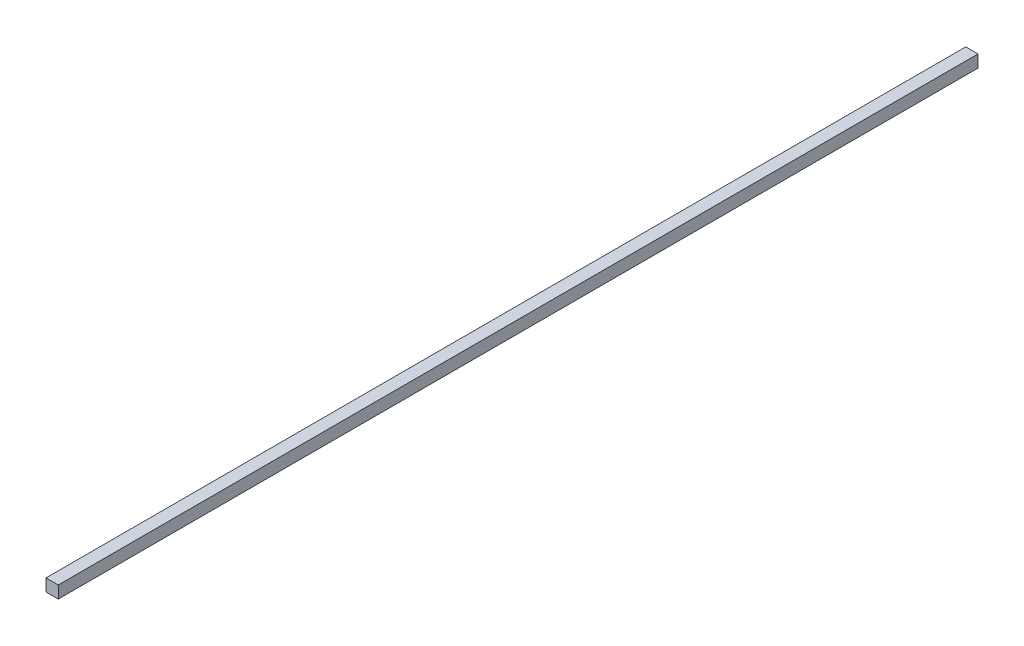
ISO-10303-21;
HEADER;
FILE_DESCRIPTION(('STEP AP214'),'2;1');
FILE_NAME('part.step','',(''),(''),'','','');
FILE_SCHEMA(('AUTOMOTIVE_DESIGN { 1 0 10303 214 1 1 1 1 }'));
ENDSEC;
DATA;
#1=APPLICATION_CONTEXT('core data for automotive mechanical design processes');
#2=APPLICATION_PROTOCOL_DEFINITION('international standard','automotive_design',2000,#1);
#3=PRODUCT_CONTEXT('',#1,'mechanical');
#4=PRODUCT('Part','Part','',(#3));
#5=PRODUCT_RELATED_PRODUCT_CATEGORY('part','',(#4));
#6=PRODUCT_DEFINITION_FORMATION('','',#4);
#7=PRODUCT_DEFINITION_CONTEXT('part definition',#1,'design');
#8=PRODUCT_DEFINITION('design','',#6,#7);
#9=PRODUCT_DEFINITION_SHAPE('','',#8);
#10=(LENGTH_UNIT() NAMED_UNIT(*) SI_UNIT(.MILLI.,.METRE.));
#11=(NAMED_UNIT(*) PLANE_ANGLE_UNIT() SI_UNIT($,.RADIAN.));
#12=(NAMED_UNIT(*) SI_UNIT($,.STERADIAN.) SOLID_ANGLE_UNIT());
#13=UNCERTAINTY_MEASURE_WITH_UNIT(LENGTH_MEASURE(1.E-05),#10,'distance_accuracy_value','');
#14=(GEOMETRIC_REPRESENTATION_CONTEXT(3) GLOBAL_UNCERTAINTY_ASSIGNED_CONTEXT((#13)) GLOBAL_UNIT_ASSIGNED_CONTEXT((#10,
#11,#12)) REPRESENTATION_CONTEXT('',''));
#15=CARTESIAN_POINT('',(0.,0.,0.));
#16=DIRECTION('',(0.,0.,1.));
#17=DIRECTION('',(1.,0.,0.));
#18=AXIS2_PLACEMENT_3D('',#15,#16,#17);
#19=CARTESIAN_POINT('',(-1.,1.,75.));
#20=DIRECTION('',(1.,0.,0.));
#21=DIRECTION('',(0.,0.,-1.));
#22=AXIS2_PLACEMENT_3D('',#19,#20,#21);
#23=PLANE('',#22);
#24=DIRECTION('',(0.,-1.,0.));
#25=VECTOR('',#24,1.);
#26=CARTESIAN_POINT('',(-1.,1.,-75.));
#27=LINE('',#26,#25);
#28=CARTESIAN_POINT('',(-1.,1.,-75.));
#29=VERTEX_POINT('',#28);
#30=CARTESIAN_POINT('',(-1.,-1.,-75.));
#31=VERTEX_POINT('',#30);
#32=EDGE_CURVE('E70',#29,#31,#27,.T.);
#33=ORIENTED_EDGE('',*,*,#32,.T.);
#34=DIRECTION('',(0.,0.,-1.));
#35=VECTOR('',#34,1.);
#36=CARTESIAN_POINT('',(-1.,-1.,75.));
#37=LINE('',#36,#35);
#38=CARTESIAN_POINT('',(-1.,-1.,75.));
#39=VERTEX_POINT('',#38);
#40=EDGE_CURVE('E11',#39,#31,#37,.T.);
#41=ORIENTED_EDGE('',*,*,#40,.F.);
#42=DIRECTION('',(0.,-1.,0.));
#43=VECTOR('',#42,1.);
#44=CARTESIAN_POINT('',(-1.,1.,75.));
#45=LINE('',#44,#43);
#46=CARTESIAN_POINT('',(-1.,1.,75.));
#47=VERTEX_POINT('',#46);
#48=EDGE_CURVE('E88',#47,#39,#45,.T.);
#49=ORIENTED_EDGE('',*,*,#48,.F.);
#50=DIRECTION('',(0.,0.,-1.));
#51=VECTOR('',#50,1.);
#52=CARTESIAN_POINT('',(-1.,1.,75.));
#53=LINE('',#52,#51);
#54=EDGE_CURVE('E82',#47,#29,#53,.T.);
#55=ORIENTED_EDGE('',*,*,#54,.T.);
#56=EDGE_LOOP('',(#33,#41,#49,#55));
#57=FACE_BOUND('',#56,.T.);
#58=ADVANCED_FACE('F26',(#57),#23,.F.);
#59=CARTESIAN_POINT('',(-1.,-1.,75.));
#60=DIRECTION('',(0.,1.,0.));
#61=DIRECTION('',(0.,0.,1.));
#62=AXIS2_PLACEMENT_3D('',#59,#60,#61);
#63=PLANE('',#62);
#64=DIRECTION('',(1.,0.,0.));
#65=VECTOR('',#64,1.);
#66=CARTESIAN_POINT('',(-1.,-1.,-75.));
#67=LINE('',#66,#65);
#68=CARTESIAN_POINT('',(1.,-1.,-75.));
#69=VERTEX_POINT('',#68);
#70=EDGE_CURVE('E66',#31,#69,#67,.T.);
#71=ORIENTED_EDGE('',*,*,#70,.T.);
#72=DIRECTION('',(0.,0.,-1.));
#73=VECTOR('',#72,1.);
#74=CARTESIAN_POINT('',(1.,-1.,75.));
#75=LINE('',#74,#73);
#76=CARTESIAN_POINT('',(1.,-1.,75.));
#77=VERTEX_POINT('',#76);
#78=EDGE_CURVE('E33',#77,#69,#75,.T.);
#79=ORIENTED_EDGE('',*,*,#78,.F.);
#80=DIRECTION('',(1.,0.,0.));
#81=VECTOR('',#80,1.);
#82=CARTESIAN_POINT('',(-1.,-1.,75.));
#83=LINE('',#82,#81);
#84=EDGE_CURVE('E78',#39,#77,#83,.T.);
#85=ORIENTED_EDGE('',*,*,#84,.F.);
#86=ORIENTED_EDGE('',*,*,#40,.T.);
#87=EDGE_LOOP('',(#71,#79,#85,#86));
#88=FACE_BOUND('',#87,.T.);
#89=ADVANCED_FACE('F77',(#88),#63,.F.);
#90=CARTESIAN_POINT('',(1.,1.,75.));
#91=DIRECTION('',(-1.,0.,0.));
#92=DIRECTION('',(0.,-1.,0.));
#93=AXIS2_PLACEMENT_3D('',#90,#91,#92);
#94=PLANE('',#93);
#95=DIRECTION('',(0.,1.,0.));
#96=VECTOR('',#95,1.);
#97=CARTESIAN_POINT('',(1.,1.,-75.));
#98=LINE('',#97,#96);
#99=CARTESIAN_POINT('',(1.,1.,-75.));
#100=VERTEX_POINT('',#99);
#101=EDGE_CURVE('E71',#69,#100,#98,.T.);
#102=ORIENTED_EDGE('',*,*,#101,.T.);
#103=DIRECTION('',(0.,0.,-1.));
#104=VECTOR('',#103,1.);
#105=CARTESIAN_POINT('',(1.,1.,75.));
#106=LINE('',#105,#104);
#107=CARTESIAN_POINT('',(1.,1.,75.));
#108=VERTEX_POINT('',#107);
#109=EDGE_CURVE('E94',#108,#100,#106,.T.);
#110=ORIENTED_EDGE('',*,*,#109,.F.);
#111=DIRECTION('',(0.,1.,0.));
#112=VECTOR('',#111,1.);
#113=CARTESIAN_POINT('',(1.,1.,75.));
#114=LINE('',#113,#112);
#115=EDGE_CURVE('E45',#77,#108,#114,.T.);
#116=ORIENTED_EDGE('',*,*,#115,.F.);
#117=ORIENTED_EDGE('',*,*,#78,.T.);
#118=EDGE_LOOP('',(#102,#110,#116,#117));
#119=FACE_BOUND('',#118,.T.);
#120=ADVANCED_FACE('F97',(#119),#94,.F.);
#121=CARTESIAN_POINT('',(-1.,1.,75.));
#122=DIRECTION('',(0.,-1.,0.));
#123=DIRECTION('',(1.,0.,0.));
#124=AXIS2_PLACEMENT_3D('',#121,#122,#123);
#125=PLANE('',#124);
#126=DIRECTION('',(-1.,0.,0.));
#127=VECTOR('',#126,1.);
#128=CARTESIAN_POINT('',(-1.,1.,-75.));
#129=LINE('',#128,#127);
#130=EDGE_CURVE('E86',#100,#29,#129,.T.);
#131=ORIENTED_EDGE('',*,*,#130,.T.);
#132=ORIENTED_EDGE('',*,*,#54,.F.);
#133=DIRECTION('',(-1.,0.,0.));
#134=VECTOR('',#133,1.);
#135=CARTESIAN_POINT('',(-1.,1.,75.));
#136=LINE('',#135,#134);
#137=EDGE_CURVE('E40',#108,#47,#136,.T.);
#138=ORIENTED_EDGE('',*,*,#137,.F.);
#139=ORIENTED_EDGE('',*,*,#109,.T.);
#140=EDGE_LOOP('',(#131,#132,#138,#139));
#141=FACE_BOUND('',#140,.T.);
#142=ADVANCED_FACE('F99',(#141),#125,.F.);
#143=CARTESIAN_POINT('',(-1.,-1.,75.));
#144=DIRECTION('',(0.,0.,1.));
#145=DIRECTION('',(1.,0.,0.));
#146=AXIS2_PLACEMENT_3D('',#143,#144,#145);
#147=PLANE('',#146);
#148=ORIENTED_EDGE('',*,*,#48,.T.);
#149=ORIENTED_EDGE('',*,*,#84,.T.);
#150=ORIENTED_EDGE('',*,*,#115,.T.);
#151=ORIENTED_EDGE('',*,*,#137,.T.);
#152=EDGE_LOOP('',(#148,#149,#150,#151));
#153=FACE_BOUND('',#152,.T.);
#154=ADVANCED_FACE('F100',(#153),#147,.T.);
#155=CARTESIAN_POINT('',(-1.,-1.,-75.));
#156=DIRECTION('',(0.,0.,1.));
#157=DIRECTION('',(1.,0.,0.));
#158=AXIS2_PLACEMENT_3D('',#155,#156,#157);
#159=PLANE('',#158);
#160=ORIENTED_EDGE('',*,*,#32,.F.);
#161=ORIENTED_EDGE('',*,*,#130,.F.);
#162=ORIENTED_EDGE('',*,*,#101,.F.);
#163=ORIENTED_EDGE('',*,*,#70,.F.);
#164=EDGE_LOOP('',(#160,#161,#162,#163));
#165=FACE_BOUND('',#164,.T.);
#166=ADVANCED_FACE('F67',(#165),#159,.F.);
#167=CLOSED_SHELL('',(#58,#89,#120,#142,#154,#166));
#168=MANIFOLD_SOLID_BREP('B2',#167);
#169=ADVANCED_BREP_SHAPE_REPRESENTATION('',(#18,#168),#14);
#170=SHAPE_DEFINITION_REPRESENTATION(#9,#169);
ENDSEC;
END-ISO-10303-21;
